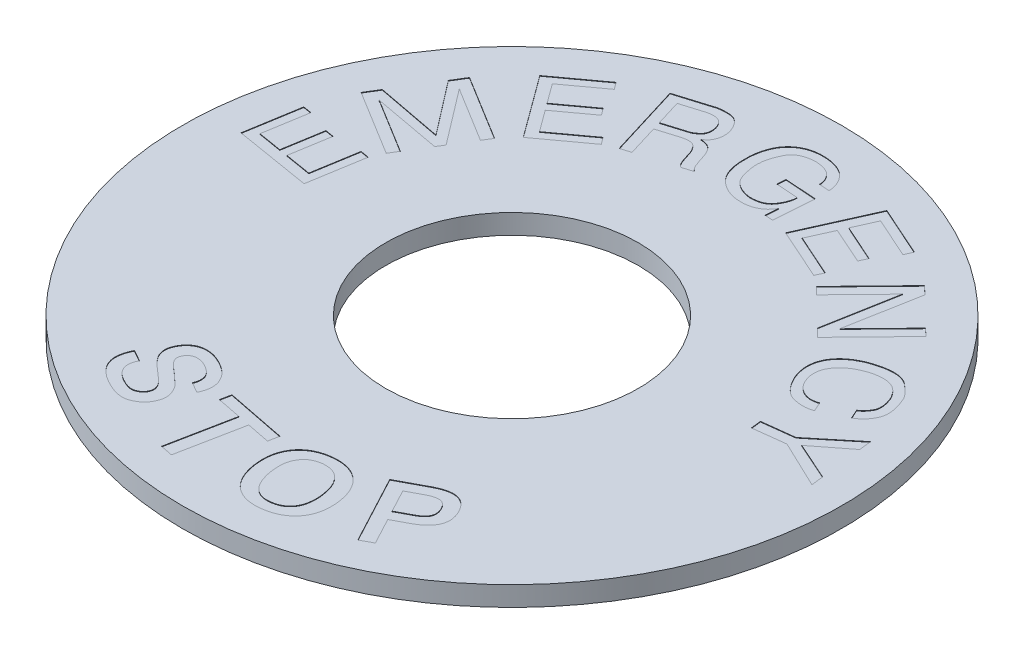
from build123d import *

# Parameters (mm, degrees)
SKETCH_1_W          = 18.5
SKETCH_1_H          = 1.8
CUT_EXTRUDE_1_DEPTH = 0.05
CUT_EXTRUDE_2_DEPTH = 0.05


with BuildPart() as part:
    # Sketch 1 → Revolve 1 (revolve)
    with BuildSketch(Plane.XY, mode=Mode.PRIVATE) as revolve_1_sk:
        with Locations((20.75, 0.9)):
            Rectangle(SKETCH_1_W, SKETCH_1_H)
    revolve(revolve_1_sk.sketch.rotate(Axis((0, 1.8, 0), (0, -1, 0)), 270), axis=Axis((0, 1.8, 0), (0, -1, 0)))

    # Sketch 2 → Cut-Extrude 1 (cut)
    # profile 1 of 9: a face of its own
    with BuildSketch(Plane(origin=(0, 1.8, 0), x_dir=(1, 0, 0), z_dir=(0, 1, 0))):
        Polygon((23.417949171, 2.954229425), (26.388753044, 5.270333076), (26.254737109, 6.377935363), (22.531008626, 3.318514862), (19.643331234, 2.969116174), (19.755808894, 2.039521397), (22.643486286, 2.388920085), (26.988235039, 0.315790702), (26.854219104, 1.423392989), align=None)
    # profile 2 of 9: a face of its own
    with BuildSketch(Plane(origin=(0, 1.8, 0), x_dir=(1, 0, 0), z_dir=(0, 1, 0))):
        with BuildLine():
            add(Edge.make_bspline(
                [(20.889990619, 7.123935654), (20.830537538, 7.103457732), (20.714265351, 7.063409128), (20.536413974, 7.025595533), (20.361522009, 7.000782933), (20.187610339, 6.997781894), (20.015499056, 7.007866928), (19.84587207, 7.039713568), (19.678060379, 7.085226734), (19.514129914, 7.149081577), (19.355311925, 7.227864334), (19.205215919, 7.3238446), (19.063303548, 7.433307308), (18.931381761, 7.559106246), (18.807143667, 7.698033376), (18.694825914, 7.854754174), (18.588726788, 8.023996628), (18.528501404, 8.145884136), (18.497828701, 8.207961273)],
                knots=[0, 0, 0, 0, 1.036290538, 2.026669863, 2.994073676, 3.945500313, 4.89083267, 5.833003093, 6.786770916, 7.755310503, 8.730089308, 9.70638147, 10.689343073, 11.681750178, 12.709240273, 13.758750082, 14.858534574, 16, 16, 16, 16], degree=3))
            add(Edge.make_bspline(
                [(18.497828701, 8.207961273), (18.464433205, 8.291942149), (18.399015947, 8.456449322), (18.33143328, 8.707795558), (18.291910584, 8.954695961), (18.279445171, 9.197010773), (18.297210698, 9.435086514), (18.342255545, 9.668698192), (18.414627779, 9.898304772), (18.516680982, 10.121226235), (18.641384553, 10.3364889), (18.788716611, 10.540719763), (18.954634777, 10.735565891), (19.144624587, 10.915965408), (19.353168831, 11.088050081), (19.58471925, 11.245422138), (19.835789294, 11.393532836), (20.014116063, 11.479551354), (20.105118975, 11.523447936)],
                knots=[0, 0, 0, 0, 1.048224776, 2.053330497, 3.013236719, 3.945598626, 4.862607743, 5.776933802, 6.701104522, 7.649538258, 8.616545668, 9.583762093, 10.568487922, 11.582097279, 12.620305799, 13.703087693, 14.827850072, 16, 16, 16, 16], degree=3))
            add(Edge.make_bspline(
                [(20.105118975, 11.523447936), (20.193548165, 11.563475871), (20.367870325, 11.642383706), (20.63387339, 11.740064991), (20.898069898, 11.819790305), (21.160375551, 11.880933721), (21.420628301, 11.921161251), (21.678801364, 11.943183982), (21.935146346, 11.946125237), (22.188647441, 11.93011049), (22.435348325, 11.888698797), (22.670199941, 11.813240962), (22.890488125, 11.70345095), (23.096686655, 11.560216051), (23.28965604, 11.384733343), (23.465113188, 11.174068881), (23.629756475, 10.933596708), (23.722738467, 10.756185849), (23.770894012, 10.664304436)],
                knots=[0, 0, 0, 0, 1.091572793, 2.151838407, 3.184663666, 4.194230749, 5.178834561, 6.144337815, 7.106491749, 8.059983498, 8.998357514, 9.91282842, 10.824115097, 11.756664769, 12.728516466, 13.748619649, 14.834005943, 16, 16, 16, 16], degree=3))
            add(Edge.make_bspline(
                [(23.770894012, 10.664304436), (23.804341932, 10.577290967), (23.868516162, 10.410344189), (23.941068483, 10.162680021), (23.989673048, 9.930832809), (24.013417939, 9.714029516), (24.014881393, 9.512696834), (23.990588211, 9.325855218), (23.942465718, 9.154238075), (23.867863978, 9.000904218), (23.782407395, 8.862795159), (23.694603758, 8.736258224), (23.606854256, 8.621561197), (23.51703333, 8.519639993), (23.42515305, 8.430839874), (23.332572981, 8.352909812), (23.237330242, 8.28943234), (23.1715287, 8.254991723), (23.13951003, 8.238233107)],
                knots=[0, 0, 0, 0, 1.603592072, 3.076702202, 4.435601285, 5.674685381, 6.824002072, 7.891659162, 8.9070321, 9.876101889, 10.814854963, 11.700198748, 12.525472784, 13.298651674, 14.035427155, 14.722506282, 15.378378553, 16, 16, 16, 16], degree=3))
            Line((23.13951003, 8.238233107), (23.526202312, 7.385293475))
            add(Edge.make_bspline(
                [(23.526202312, 7.385293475), (23.587258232, 7.41868781), (23.709271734, 7.485422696), (23.881267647, 7.604763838), (24.043014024, 7.739178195), (24.194165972, 7.888299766), (24.336897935, 8.049989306), (24.466469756, 8.229047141), (24.586925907, 8.421640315), (24.698515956, 8.62809004), (24.790387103, 8.853217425), (24.845615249, 9.100993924), (24.867459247, 9.367951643), (24.858686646, 9.654840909), (24.812344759, 9.961223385), (24.739330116, 10.288023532), (24.629146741, 10.633694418), (24.536822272, 10.867140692), (24.488768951, 10.988645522)],
                knots=[0, 0, 0, 0, 0.799857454, 1.598426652, 2.402862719, 3.21562535, 4.037986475, 4.880177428, 5.754093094, 6.648948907, 7.576559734, 8.540348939, 9.555428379, 10.650039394, 11.833180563, 13.113414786, 14.497581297, 16, 16, 16, 16], degree=3))
            add(Edge.make_bspline(
                [(24.488768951, 10.988645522), (24.473489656, 11.039703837), (24.441047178, 11.148115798), (24.355681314, 11.30879076), (24.244674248, 11.479871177), (24.102611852, 11.660587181), (23.932556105, 11.851509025), (23.732469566, 12.052260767), (23.502005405, 12.261666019), (23.293471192, 12.443145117), (23.108101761, 12.582903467), (22.953901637, 12.674080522), (22.788728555, 12.750730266), (22.612396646, 12.812468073), (22.425252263, 12.860032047), (22.227609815, 12.893415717), (22.018807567, 12.909361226), (21.799739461, 12.914514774), (21.569635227, 12.901828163), (21.328598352, 12.875683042), (21.076531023, 12.835061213), (20.813538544, 12.779752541), (20.539947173, 12.710385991), (20.255166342, 12.6265898), (19.959993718, 12.526504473), (19.760411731, 12.452292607), (19.658249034, 12.414304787)],
                knots=[0, 0, 0, 0, 0.669854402, 1.422299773, 2.280131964, 3.237717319, 4.313798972, 5.499240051, 6.805685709, 8.23545015, 8.979893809, 9.726180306, 10.487048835, 11.269936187, 12.075809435, 12.916562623, 13.791098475, 14.711210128, 15.674725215, 16.691294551, 17.763898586, 18.88914982, 20.075193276, 21.318074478, 22.627166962, 24, 24, 24, 24], degree=3))
            add(Edge.make_bspline(
                [(19.658249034, 12.414304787), (19.5348442, 12.354489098), (19.294907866, 12.238189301), (18.958728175, 12.04020371), (18.656249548, 11.826207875), (18.384471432, 11.598281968), (18.146260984, 11.353798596), (17.937552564, 11.096439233), (17.76371555, 10.822515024), (17.623681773, 10.534594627), (17.515888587, 10.235684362), (17.445656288, 9.92680012), (17.408657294, 9.610620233), (17.410522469, 9.286374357), (17.442560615, 8.953743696), (17.515719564, 8.614003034), (17.620655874, 8.265994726), (17.7154508, 8.037113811), (17.764097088, 7.919658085)],
                knots=[0, 0, 0, 0, 1.191092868, 2.315844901, 3.384928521, 4.406908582, 5.392897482, 6.346057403, 7.280643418, 8.204813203, 9.122501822, 10.034905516, 10.950921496, 11.881845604, 12.846780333, 13.848897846, 14.896110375, 16, 16, 16, 16], degree=3))
            add(Edge.make_bspline(
                [(17.764097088, 7.919658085), (17.824830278, 7.802882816), (17.941801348, 7.577975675), (18.138920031, 7.268267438), (18.343039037, 6.996226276), (18.555039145, 6.760950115), (18.778300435, 6.566801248), (19.008786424, 6.407957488), (19.249690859, 6.289526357), (19.498348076, 6.213160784), (19.745557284, 6.165661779), (19.985976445, 6.12956331), (20.21965384, 6.112495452), (20.445546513, 6.110617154), (20.664310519, 6.125011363), (20.87514367, 6.154710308), (21.078726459, 6.202276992), (21.209170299, 6.246887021), (21.274188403, 6.269122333)],
                knots=[0, 0, 0, 0, 1.465449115, 2.822429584, 4.083307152, 5.250060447, 6.342550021, 7.371212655, 8.35972147, 9.319415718, 10.258779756, 11.16170277, 12.025723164, 12.865963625, 13.675846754, 14.465242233, 15.235019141, 16, 16, 16, 16], degree=3))
            Line((21.274188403, 6.269122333), (20.889990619, 7.123935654))
        make_face()
    # profile 3 of 9: a face of its own
    with BuildSketch(Plane(origin=(0, 1.8, 0), x_dir=(1, 0, 0), z_dir=(0, 1, 0))):
        Polygon((16.079054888, 19.458764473), (14.88869776, 12.90504176), (15.624263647, 12.189775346), (20.485297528, 17.188766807), (19.814004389, 17.841534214), (15.959898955, 13.878048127), (17.157397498, 20.424826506), (16.414690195, 21.147037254), (11.553656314, 16.148045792), (12.224949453, 15.495278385), align=None)
    # profile 4 of 9: a face of its own
    with BuildSketch(Plane(origin=(0, 1.8, 0), x_dir=(1, 0, 0), z_dir=(0, 1, 0))):
        Polygon((8.416225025, 22.241603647), (9.310950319, 24.241960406), (12.993425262, 22.594852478), (13.314712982, 23.313162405), (8.777540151, 25.34256205), (5.930686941, 18.977790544), (10.56787761, 16.903654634), (10.889165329, 17.621964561), (7.106672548, 19.313808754), (8.094937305, 21.52329372), (11.431896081, 20.030729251), (11.7531838, 20.749039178), align=None)
    # profile 5 of 9: a face of its own
    with BuildSketch(Plane(origin=(0, 1.8, 0), x_dir=(1, 0, 0), z_dir=(0, 1, 0))):
        with BuildLine():
            Line((1.75059009, 23.202484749), (1.695652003, 22.417448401))
            Line((1.695652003, 22.417448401), (3.683085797, 22.278364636))
            add(Edge.make_bspline(
                [(3.683085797, 22.278364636), (3.678770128, 22.219657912), (3.670069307, 22.101299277), (3.64317208, 21.923534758), (3.598375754, 21.745837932), (3.543103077, 21.566476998), (3.470104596, 21.387680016), (3.38322738, 21.208962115), (3.283069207, 21.029171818), (3.170213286, 20.850448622), (3.038810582, 20.67974017), (2.876691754, 20.535085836), (2.693764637, 20.410634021), (2.484251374, 20.312585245), (2.251033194, 20.238513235), (1.994425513, 20.186881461), (1.713795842, 20.160171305), (1.519138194, 20.159590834), (1.417698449, 20.159288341)],
                knots=[0, 0, 0, 0, 0.806980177, 1.626952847, 2.461069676, 3.31747325, 4.19833721, 5.105898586, 6.040811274, 7.018569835, 8.003251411, 8.9826733, 9.984030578, 11.027252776, 12.141923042, 13.331928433, 14.609617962, 16, 16, 16, 16], degree=3))
            add(Edge.make_bspline(
                [(1.417698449, 20.159288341), (1.352714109, 20.170211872), (1.225066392, 20.191668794), (1.039823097, 20.23347065), (0.863904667, 20.282198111), (0.698809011, 20.340317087), (0.542406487, 20.403190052), (0.396473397, 20.473975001), (0.260404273, 20.551693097), (0.134608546, 20.637538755), (0.016891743, 20.728786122), (-0.087778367, 20.831111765), (-0.185245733, 20.93752237), (-0.272301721, 21.051459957), (-0.3471742, 21.174558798), (-0.41516343, 21.302948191), (-0.471705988, 21.439655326), (-0.530334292, 21.627285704), (-0.590504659, 21.857089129), (-0.655404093, 22.119107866), (-0.704076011, 22.361157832), (-0.740933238, 22.582241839), (-0.764462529, 22.782855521), (-0.775454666, 22.962850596), (-0.772761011, 23.122743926), (-0.758469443, 23.221154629), (-0.751783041, 23.267196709)],
                knots=[0, 0, 0, 0, 1.112757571, 2.185772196, 3.205765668, 4.193880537, 5.14029101, 6.051315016, 6.931078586, 7.784161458, 8.621936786, 9.44271661, 10.252835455, 11.057898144, 11.859640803, 12.683623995, 13.509523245, 14.353876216, 16.001622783, 17.521176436, 18.912204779, 20.170327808, 21.305817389, 22.32183212, 23.214858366, 24, 24, 24, 24], degree=3))
            add(Edge.make_bspline(
                [(-0.751783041, 23.267196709), (-0.750905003, 23.324924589), (-0.749084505, 23.44461583), (-0.725370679, 23.62897299), (-0.690137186, 23.824331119), (-0.635251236, 24.029471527), (-0.566130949, 24.245522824), (-0.48033821, 24.472341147), (-0.378938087, 24.70968343), (-0.284949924, 24.913016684), (-0.198804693, 25.07531326), (-0.123998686, 25.191290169), (-0.038469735, 25.297518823), (0.054375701, 25.396529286), (0.15576916, 25.487494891), (0.265333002, 25.571389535), (0.384025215, 25.64659466), (0.511380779, 25.712354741), (0.646440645, 25.772175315), (0.790424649, 25.823853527), (0.943609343, 25.867100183), (1.105104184, 25.901018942), (1.274885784, 25.928627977), (1.452851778, 25.948649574), (1.640008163, 25.960479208), (1.767488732, 25.961081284), (1.83285504, 25.961390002)],
                knots=[0, 0, 0, 0, 0.981801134, 2.035636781, 3.158318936, 4.358242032, 5.646082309, 7.01755135, 8.483175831, 10.037799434, 10.828110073, 11.608330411, 12.382226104, 13.145814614, 13.915899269, 14.6976607, 15.491643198, 16.303612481, 17.134708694, 18.003796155, 18.904618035, 19.841248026, 20.810505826, 21.830912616, 22.88778946, 24, 24, 24, 24], degree=3))
            add(Edge.make_bspline(
                [(1.83285504, 25.961390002), (1.917567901, 25.951352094), (2.081000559, 25.931986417), (2.315276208, 25.887563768), (2.528375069, 25.830503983), (2.720871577, 25.761638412), (2.891747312, 25.679203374), (3.04328721, 25.586015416), (3.17317946, 25.478969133), (3.279532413, 25.358931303), (3.369875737, 25.23466836), (3.447902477, 25.109355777), (3.513309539, 24.983673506), (3.565485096, 24.857183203), (3.60631281, 24.730536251), (3.63370085, 24.603087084), (3.649066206, 24.475091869), (3.648171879, 24.389695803), (3.647723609, 24.346892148)],
                knots=[0, 0, 0, 0, 1.512908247, 2.918784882, 4.22553858, 5.422732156, 6.539713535, 7.585062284, 8.571629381, 9.513091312, 10.421764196, 11.294548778, 12.129426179, 12.93195792, 13.719087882, 14.486448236, 15.241352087, 16, 16, 16, 16], degree=3))
            Line((3.647723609, 24.346892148), (4.582262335, 24.282506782))
            add(Edge.make_bspline(
                [(4.582262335, 24.282506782), (4.578105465, 24.356459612), (4.56985033, 24.503322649), (4.535017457, 24.720546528), (4.479250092, 24.931343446), (4.407747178, 25.137520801), (4.314441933, 25.336797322), (4.20311388, 25.530700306), (4.07242397, 25.718338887), (3.92477996, 25.900694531), (3.75472607, 26.071453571), (3.560716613, 26.225074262), (3.341751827, 26.35809417), (3.099924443, 26.472865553), (2.83543456, 26.571553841), (2.546853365, 26.647692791), (2.235936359, 26.709535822), (2.01953608, 26.733303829), (1.907813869, 26.745574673)],
                knots=[0, 0, 0, 0, 0.884221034, 1.755975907, 2.62174135, 3.485678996, 4.358641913, 5.245546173, 6.152915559, 7.086845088, 8.044504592, 9.025001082, 10.034818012, 11.097471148, 12.217813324, 13.40111485, 14.65825868, 16, 16, 16, 16], degree=3))
            add(Edge.make_bspline(
                [(1.907813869, 26.745574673), (1.780020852, 26.751617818), (1.531054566, 26.763391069), (1.165330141, 26.743921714), (0.818972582, 26.695372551), (0.490038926, 26.618185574), (0.180715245, 26.507789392), (-0.110565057, 26.369422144), (-0.382964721, 26.20048292), (-0.635286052, 26.00166449), (-0.865583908, 25.772508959), (-1.072056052, 25.514640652), (-1.24890541, 25.225581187), (-1.400640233, 24.908937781), (-1.527446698, 24.564350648), (-1.627977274, 24.191006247), (-1.701288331, 23.788722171), (-1.729184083, 23.510105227), (-1.743546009, 23.366661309)],
                knots=[0, 0, 0, 0, 1.086927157, 2.117550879, 3.107581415, 4.056627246, 4.98416045, 5.893943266, 6.792731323, 7.702990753, 8.618513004, 9.548524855, 10.50403478, 11.492319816, 12.52871395, 13.620571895, 14.774968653, 16, 16, 16, 16], degree=3))
            add(Edge.make_bspline(
                [(-1.743546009, 23.366661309), (-1.747077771, 23.281625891), (-1.753999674, 23.114964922), (-1.75318405, 22.869284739), (-1.746822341, 22.632701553), (-1.730689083, 22.405297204), (-1.707557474, 22.186541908), (-1.6779955, 21.976677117), (-1.639206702, 21.775504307), (-1.590854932, 21.584013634), (-1.538396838, 21.400183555), (-1.476644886, 21.225752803), (-1.405498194, 21.060997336), (-1.327637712, 20.90501433), (-1.242790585, 20.757123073), (-1.148551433, 20.618987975), (-1.048286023, 20.488262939), (-0.901744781, 20.330766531), (-0.708928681, 20.150235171), (-0.464191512, 19.957410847), (-0.205644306, 19.79396227), (0.063885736, 19.655965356), (0.346119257, 19.544218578), (0.641268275, 19.461108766), (0.948173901, 19.403399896), (1.157506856, 19.388440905), (1.263456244, 19.380869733)],
                knots=[0, 0, 0, 0, 1.082125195, 2.120857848, 3.123394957, 4.091142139, 5.018946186, 5.920215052, 6.785406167, 7.622703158, 8.430959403, 9.215589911, 9.973770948, 10.711562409, 11.431554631, 12.139941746, 12.836610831, 13.524245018, 14.872951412, 16.191804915, 17.480070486, 18.756223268, 20.037237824, 21.333117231, 22.650214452, 24, 24, 24, 24], degree=3))
            add(Edge.make_bspline(
                [(1.263456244, 19.380869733), (1.331193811, 19.377603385), (1.464241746, 19.371187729), (1.661079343, 19.376480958), (1.85129474, 19.390000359), (2.035248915, 19.416164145), (2.213031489, 19.453478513), (2.384322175, 19.502707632), (2.549396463, 19.561514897), (2.707114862, 19.632226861), (2.856637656, 19.715051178), (2.999364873, 19.805069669), (3.133597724, 19.90556641), (3.257800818, 20.016121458), (3.374985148, 20.135572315), (3.482246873, 20.265253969), (3.582545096, 20.403631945), (3.641236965, 20.501902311), (3.670787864, 20.551380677)],
                knots=[0, 0, 0, 0, 1.148899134, 2.256630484, 3.334600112, 4.379109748, 5.402843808, 6.410649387, 7.397175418, 8.370335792, 9.336074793, 10.291632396, 11.228089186, 12.174162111, 13.107036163, 14.06103112, 15.023744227, 16, 16, 16, 16], degree=3))
            Line((3.670787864, 20.551380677), (3.691961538, 20.55019396))
            Line((3.691961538, 20.55019396), (3.613379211, 19.427293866))
            Line((3.613379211, 19.427293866), (4.338792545, 19.376528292))
            Line((4.338792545, 19.376528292), (4.592620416, 23.003594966))
            Line((4.592620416, 23.003594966), (1.75059009, 23.202484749))
        make_face()
    # profile 6 of 9: a face of its own
    with BuildSketch(Plane(origin=(0, 1.8, 0), x_dir=(1, 0, 0), z_dir=(0, 1, 0))):
        with BuildLine():
            Line((-8.298712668, 18.053027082), (-7.403125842, 18.326810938))
            Line((-7.403125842, 18.326810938), (-8.268166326, 21.156484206))
            Line((-8.268166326, 21.156484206), (-6.362662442, 21.73900305))
            add(Edge.make_bspline(
                [(-6.362662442, 21.73900305), (-6.293140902, 21.756445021), (-6.16031168, 21.789769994), (-5.967040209, 21.821938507), (-5.789434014, 21.836030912), (-5.628283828, 21.831105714), (-5.482532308, 21.807726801), (-5.354679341, 21.762492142), (-5.241191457, 21.700466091), (-5.117615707, 21.586964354), (-4.986622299, 21.422658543), (-4.85277735, 21.204769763), (-4.744576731, 20.963480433), (-4.696277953, 20.791101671), (-4.671565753, 20.702903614)],
                knots=[0, 0, 0, 0, 1.112617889, 2.125789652, 3.038516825, 3.874692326, 4.624151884, 5.320276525, 5.971788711, 6.616817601, 7.910322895, 9.223221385, 10.579253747, 12, 12, 12, 12], degree=3))
            add(Edge.make_bspline(
                [(-4.671565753, 20.702903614), (-4.655738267, 20.652440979), (-4.625129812, 20.554852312), (-4.580450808, 20.414065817), (-4.539277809, 20.283308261), (-4.497073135, 20.164589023), (-4.458313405, 20.056415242), (-4.422279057, 19.959158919), (-4.388072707, 19.872939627), (-4.34461708, 19.774036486), (-4.286869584, 19.663770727), (-4.201930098, 19.548680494), (-4.105123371, 19.448429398), (-4.030054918, 19.395768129), (-3.992611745, 19.369501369)],
                knots=[0, 0, 0, 0, 1.246175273, 2.409953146, 3.480555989, 4.476018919, 5.378543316, 6.188227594, 6.91989817, 7.563679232, 8.733883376, 9.843528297, 10.924379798, 12, 12, 12, 12], degree=3))
            Line((-3.992611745, 19.369501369), (-3.049049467, 19.657866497))
            add(Edge.make_bspline(
                [(-3.049049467, 19.657866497), (-3.093103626, 19.693233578), (-3.180182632, 19.7631414), (-3.292665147, 19.887637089), (-3.38507553, 20.02720684), (-3.447409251, 20.155532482), (-3.492887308, 20.267969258), (-3.527834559, 20.364856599), (-3.569434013, 20.471197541), (-3.610367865, 20.589904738), (-3.655505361, 20.718845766), (-3.70060403, 20.859341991), (-3.752310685, 21.009006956), (-3.785275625, 21.113175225), (-3.802331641, 21.167071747)],
                knots=[0, 0, 0, 0, 1.183534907, 2.339416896, 3.502220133, 4.683095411, 5.325024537, 6.045741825, 6.843133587, 7.719708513, 8.679048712, 9.708460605, 10.8143606, 12, 12, 12, 12], degree=3))
            add(Edge.make_bspline(
                [(-3.802331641, 21.167071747), (-3.828711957, 21.251680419), (-3.880344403, 21.417279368), (-3.981416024, 21.651961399), (-4.102314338, 21.866161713), (-4.215865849, 22.031692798), (-4.321197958, 22.151925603), (-4.416231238, 22.229511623), (-4.523713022, 22.297648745), (-4.644336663, 22.355180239), (-4.778115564, 22.403019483), (-4.925610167, 22.439226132), (-5.086214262, 22.469371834), (-5.1985454, 22.47846065), (-5.256821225, 22.4831758)],
                knots=[0, 0, 0, 0, 1.495406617, 2.926860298, 4.303225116, 5.642202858, 6.308416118, 6.993856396, 7.704925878, 8.452266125, 9.245059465, 10.098867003, 11.013718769, 12, 12, 12, 12], degree=3))
            Line((-5.256821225, 22.4831758), (-5.265468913, 22.511970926))
            add(Edge.make_bspline(
                [(-5.265468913, 22.511970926), (-5.224562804, 22.536630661), (-5.143458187, 22.585523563), (-5.033098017, 22.672037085), (-4.934058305, 22.767428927), (-4.843881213, 22.868821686), (-4.767524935, 22.981500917), (-4.701037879, 23.100970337), (-4.645700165, 23.228870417), (-4.589188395, 23.409945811), (-4.542012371, 23.644410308), (-4.528342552, 23.932199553), (-4.552842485, 24.222857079), (-4.601983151, 24.412452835), (-4.626878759, 24.508505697)],
                knots=[0, 0, 0, 0, 0.758147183, 1.503179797, 2.221137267, 2.940553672, 3.653993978, 4.378252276, 5.109832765, 5.862914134, 7.388158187, 8.893643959, 10.426260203, 12, 12, 12, 12], degree=3))
            add(Edge.make_bspline(
                [(-4.626878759, 24.508505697), (-4.664013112, 24.603460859), (-4.734983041, 24.784935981), (-4.865247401, 25.033779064), (-5.009562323, 25.246934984), (-5.165124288, 25.427286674), (-5.335857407, 25.571107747), (-5.520220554, 25.680018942), (-5.7184184, 25.753812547), (-5.927010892, 25.786212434), (-6.134495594, 25.798158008), (-6.337024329, 25.803534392), (-6.5313229, 25.797048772), (-6.718299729, 25.784141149), (-6.896442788, 25.756658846), (-7.067486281, 25.725223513), (-7.229524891, 25.679892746), (-7.333292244, 25.642628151), (-7.384498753, 25.624239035)],
                knots=[0, 0, 0, 0, 1.436381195, 2.745163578, 3.949311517, 5.057937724, 6.091620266, 7.081297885, 8.062690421, 9.052576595, 10.043736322, 10.992159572, 11.90690193, 12.78322686, 13.631868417, 14.44611036, 15.23319559, 16, 16, 16, 16], degree=3))
            Line((-7.384498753, 25.624239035), (-10.337528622, 24.722290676))
            Line((-10.337528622, 24.722290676), (-8.298712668, 18.053027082))
        make_face()
        with BuildLine():
            Line((-9.211846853, 24.243400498), (-7.344453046, 24.814268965))
            add(Edge.make_bspline(
                [(-7.344453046, 24.814268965), (-7.292615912, 24.830181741), (-7.191186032, 24.861318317), (-7.039415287, 24.897097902), (-6.89275396, 24.923951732), (-6.750981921, 24.937500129), (-6.614770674, 24.944472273), (-6.48296307, 24.938918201), (-6.356475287, 24.920641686), (-6.23439107, 24.896542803), (-6.119207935, 24.855693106), (-6.011656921, 24.79924619), (-5.91278564, 24.726124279), (-5.822147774, 24.637116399), (-5.742346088, 24.530533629), (-5.667764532, 24.410032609), (-5.603116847, 24.272483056), (-5.568710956, 24.173465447), (-5.550890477, 24.122179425)],
                knots=[0, 0, 0, 0, 1.180536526, 2.309959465, 3.393769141, 4.424556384, 5.409053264, 6.362187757, 7.291533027, 8.19045464, 9.067489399, 9.942774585, 10.825967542, 11.736086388, 12.69882219, 13.718180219, 14.81813487, 16, 16, 16, 16], degree=3))
            add(Edge.make_bspline(
                [(-5.550890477, 24.122179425), (-5.536691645, 24.060418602), (-5.509370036, 23.941577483), (-5.489600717, 23.766650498), (-5.485804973, 23.604383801), (-5.499475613, 23.4540802), (-5.532214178, 23.315825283), (-5.584704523, 23.190451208), (-5.65467539, 23.077322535), (-5.770097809, 22.948697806), (-5.925979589, 22.81313421), (-6.116056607, 22.679139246), (-6.304965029, 22.578118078), (-6.435212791, 22.53933904), (-6.49796645, 22.520655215)],
                knots=[0, 0, 0, 0, 1.08193845, 2.081882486, 3.001463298, 3.85099014, 4.653398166, 5.418752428, 6.163624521, 6.914264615, 8.362281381, 9.683126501, 10.883725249, 12, 12, 12, 12], degree=3))
            Line((-6.49796645, 22.520655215), (-8.498261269, 21.90915824))
            Line((-8.498261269, 21.90915824), (-9.211846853, 24.243400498))
        make_face(mode=Mode.SUBTRACT)
    # profile 7 of 9: a face of its own
    with BuildSketch(Plane(origin=(0, 1.8, 0), x_dir=(1, 0, 0), z_dir=(0, 1, 0))):
        Polygon((-15.143063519, 18.338429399), (-16.437612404, 20.107130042), (-13.181595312, 22.490276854), (-13.646456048, 23.125401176), (-17.658190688, 20.18912893), (-13.539171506, 14.561445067), (-9.439001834, 17.562444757), (-9.90386257, 18.197569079), (-13.248314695, 15.749694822), (-14.678202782, 17.703305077), (-11.727688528, 19.862847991), (-12.192549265, 20.497972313), align=None)
    # profile 8 of 9: a face of its own
    with BuildSketch(Plane(origin=(0, 1.8, 0), x_dir=(1, 0, 0), z_dir=(0, 1, 0))):
        Polygon((-16.840825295, 9.802715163), (-16.444115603, 10.447528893), (-20.24802841, 15.442765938), (-20.232368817, 15.468219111), (-20.013729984, 15.310313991), (-15.253986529, 12.381970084), (-14.763319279, 13.179502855), (-20.702393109, 16.833407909), (-21.438393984, 15.637108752), (-17.694534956, 10.772385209), (-23.724694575, 11.920945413), (-24.46069545, 10.724646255), (-18.52162162, 7.070741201), (-18.03095437, 7.868273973), (-22.790697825, 10.79661788), (-23.030216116, 10.920585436), (-23.019776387, 10.937554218), align=None)
    # profile 9 of 9: a face of its own
    with BuildSketch(Plane(origin=(0, 1.8, 0), x_dir=(1, 0, 0), z_dir=(0, 1, 0))):
        Polygon((-23.649245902, 2.508542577), (-25.811266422, 2.866556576), (-25.152195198, 6.846639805), (-25.928557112, 6.975199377), (-26.740597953, 2.071343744), (-19.861441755, 0.932208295), (-19.031500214, 5.944164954), (-19.807862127, 6.072724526), (-20.484834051, 1.984540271), (-22.872883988, 2.379983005), (-22.275651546, 5.986626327), (-23.05201346, 6.115185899), align=None)
    extrude(amount=-CUT_EXTRUDE_1_DEPTH, mode=Mode.SUBTRACT)

    # Sketch 4 → Cut-Extrude 2 (cut)
    # profile 1 of 4: a face of its own
    with BuildSketch(Plane(origin=(0, 1.8, 0), x_dir=(1, 0, 0), z_dir=(0, 1, 0))):
        with BuildLine():
            Line((-14.429915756, -19.940120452), (-13.383426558, -20.522103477))
            add(Edge.make_bspline(
                [(-13.383426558, -20.522103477), (-13.421799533, -20.594597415), (-13.49531398, -20.733480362), (-13.571134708, -20.948209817), (-13.61771792, -21.154486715), (-13.630499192, -21.35464813), (-13.611038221, -21.548266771), (-13.56176406, -21.737484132), (-13.480559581, -21.921466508), (-13.371309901, -22.10197357), (-13.228918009, -22.276715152), (-13.050028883, -22.441831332), (-12.838075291, -22.601196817), (-12.679181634, -22.693699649), (-12.59619662, -22.742010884)],
                knots=[0, 0, 0, 0, 1.097461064, 2.102501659, 3.040329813, 3.922301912, 4.776636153, 5.636547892, 6.5303937, 7.461042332, 8.455446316, 9.538905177, 10.714649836, 12, 12, 12, 12], degree=3))
            add(Edge.make_bspline(
                [(-12.59619662, -22.742010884), (-12.529076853, -22.778344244), (-12.400127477, -22.848147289), (-12.208631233, -22.936073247), (-12.028255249, -23.004720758), (-11.859618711, -23.053094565), (-11.702766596, -23.086337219), (-11.556507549, -23.097851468), (-11.421409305, -23.088687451), (-11.298042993, -23.061204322), (-11.186178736, -23.019216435), (-11.081631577, -22.972374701), (-10.985352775, -22.918163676), (-10.896992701, -22.857363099), (-10.817501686, -22.789419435), (-10.744524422, -22.71659096), (-10.682361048, -22.634470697), (-10.646748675, -22.575794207), (-10.628796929, -22.546216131)],
                knots=[0, 0, 0, 0, 1.640238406, 3.151198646, 4.52591609, 5.784461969, 6.919134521, 7.966909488, 8.927137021, 9.819138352, 10.67301845, 11.491352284, 12.279799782, 13.044684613, 13.792928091, 14.524983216, 15.256462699, 16, 16, 16, 16], degree=3))
            add(Edge.make_bspline(
                [(-10.628796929, -22.546216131), (-10.602511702, -22.495267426), (-10.551784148, -22.396942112), (-10.51018253, -22.240745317), (-10.49641982, -22.087755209), (-10.51549026, -21.939230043), (-10.557423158, -21.798252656), (-10.61202903, -21.663380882), (-10.684751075, -21.538239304), (-10.773364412, -21.420547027), (-10.877015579, -21.305637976), (-10.992265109, -21.18447028), (-11.122561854, -21.058454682), (-11.216336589, -20.974584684), (-11.264792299, -20.931246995)],
                knots=[0, 0, 0, 0, 1.079737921, 2.083773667, 3.030226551, 3.963151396, 4.891224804, 5.801896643, 6.70424221, 7.615310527, 8.578706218, 9.624634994, 10.772590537, 12, 12, 12, 12], degree=3))
            add(Edge.make_bspline(
                [(-11.264792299, -20.931246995), (-11.40031295, -20.813816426), (-11.679001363, -20.572328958), (-12.028544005, -20.268159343), (-12.303889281, -20.015706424), (-12.491450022, -19.824208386), (-12.658395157, -19.634912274), (-12.80531158, -19.446635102), (-12.928721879, -19.252788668), (-13.01952237, -19.045798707), (-13.083458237, -18.828516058), (-13.112866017, -18.639386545), (-13.120706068, -18.483599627), (-13.115002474, -18.363387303), (-13.098808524, -18.241393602), (-13.070948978, -18.117990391), (-13.034671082, -17.991921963), (-12.987141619, -17.863843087), (-12.929183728, -17.733790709), (-12.883047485, -17.648801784), (-12.859506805, -17.60543681)],
                knots=[0, 0, 0, 0, 2.364140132, 4.861683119, 6.108761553, 7.28791608, 8.393777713, 9.434700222, 10.434203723, 11.414497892, 12.404069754, 13.412866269, 13.929678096, 14.458345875, 14.997140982, 15.550031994, 16.124690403, 16.725471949, 17.34968143, 18, 18, 18, 18], degree=3))
            add(Edge.make_bspline(
                [(-12.859506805, -17.60543681), (-12.81250529, -17.527047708), (-12.719594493, -17.372091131), (-12.545709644, -17.166659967), (-12.350806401, -16.985875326), (-12.169499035, -16.858337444), (-12.013189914, -16.771671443), (-11.888718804, -16.715879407), (-11.757301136, -16.672013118), (-11.620319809, -16.636147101), (-11.47653586, -16.612472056), (-11.326339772, -16.597736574), (-11.169813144, -16.592125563), (-11.007020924, -16.598115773), (-10.838552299, -16.613499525), (-10.665101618, -16.644325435), (-10.486394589, -16.686021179), (-10.302863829, -16.741574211), (-10.115264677, -16.811049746), (-9.922742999, -16.892326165), (-9.725677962, -16.98709046), (-9.594196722, -17.05760314), (-9.526945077, -17.093669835)],
                knots=[0, 0, 0, 0, 1.437710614, 2.842011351, 4.221757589, 5.616306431, 6.32077064, 7.034872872, 7.761292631, 8.500708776, 9.262986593, 10.053809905, 10.876716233, 11.7279655, 12.61826564, 13.539067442, 14.500383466, 15.50746043, 16.557182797, 17.6501173, 18.798053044, 20, 20, 20, 20], degree=3))
            add(Edge.make_bspline(
                [(-9.526945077, -17.093669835), (-9.462715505, -17.130949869), (-9.337153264, -17.203828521), (-9.157878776, -17.319872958), (-8.993181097, -17.442112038), (-8.840150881, -17.566632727), (-8.702119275, -17.697462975), (-8.575858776, -17.830257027), (-8.464832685, -17.969132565), (-8.366499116, -18.110631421), (-8.280102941, -18.253718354), (-8.205299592, -18.397000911), (-8.143597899, -18.540411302), (-8.091480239, -18.68211779), (-8.052375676, -18.823572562), (-8.023605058, -18.963793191), (-8.00702446, -19.10384861), (-8.002657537, -19.290390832), (-8.018393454, -19.526070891), (-8.074359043, -19.811171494), (-8.162916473, -20.100764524), (-8.247041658, -20.289304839), (-8.290062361, -20.385722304)],
                knots=[0, 0, 0, 0, 1.128099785, 2.205319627, 3.241931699, 4.242606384, 5.200358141, 6.12911416, 7.023977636, 7.898388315, 8.745036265, 9.56157811, 10.351668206, 11.115186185, 11.853424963, 12.578887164, 13.287923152, 13.992494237, 15.411110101, 16.866104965, 18.397360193, 20, 20, 20, 20], degree=3))
            Line((-8.290062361, -20.385722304), (-9.258233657, -19.846949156))
            add(Edge.make_bspline(
                [(-9.258233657, -19.846949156), (-9.239555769, -19.80355732), (-9.20308896, -19.718838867), (-9.160636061, -19.589266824), (-9.131512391, -19.460799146), (-9.111176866, -19.334044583), (-9.107337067, -19.20828148), (-9.109611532, -19.083853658), (-9.128618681, -18.960641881), (-9.156133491, -18.838035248), (-9.199225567, -18.716537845), (-9.26249155, -18.59823865), (-9.344483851, -18.483289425), (-9.444401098, -18.370608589), (-9.56181752, -18.259643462), (-9.699832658, -18.153900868), (-9.853666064, -18.047515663), (-9.965730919, -17.983151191), (-10.023858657, -17.949765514)],
                knots=[0, 0, 0, 0, 0.982764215, 1.918754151, 2.832115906, 3.722274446, 4.584802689, 5.446974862, 6.307976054, 7.173600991, 8.059461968, 8.981237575, 9.955754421, 10.991076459, 12.110867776, 13.311894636, 14.605687, 16, 16, 16, 16], degree=3))
            add(Edge.make_bspline(
                [(-10.023858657, -17.949765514), (-10.090445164, -17.914614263), (-10.218767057, -17.846872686), (-10.411719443, -17.764252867), (-10.598225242, -17.709118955), (-10.77546305, -17.673482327), (-10.94374532, -17.663681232), (-11.102557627, -17.66942162), (-11.250866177, -17.702130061), (-11.389616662, -17.750824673), (-11.515845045, -17.822591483), (-11.628564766, -17.913641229), (-11.72762141, -18.024595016), (-11.779654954, -18.109989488), (-11.806266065, -18.153662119)],
                knots=[0, 0, 0, 0, 1.3442113, 2.590490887, 3.739738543, 4.811519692, 5.810117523, 6.74359778, 7.638865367, 8.510853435, 9.36014082, 10.2173759, 11.088326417, 12, 12, 12, 12], degree=3))
            add(Edge.make_bspline(
                [(-11.806266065, -18.153662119), (-11.832944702, -18.206871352), (-11.883252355, -18.307207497), (-11.925982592, -18.463393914), (-11.932881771, -18.612927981), (-11.902084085, -18.752988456), (-11.848210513, -18.882827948), (-11.777636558, -19.004414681), (-11.697559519, -19.122297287), (-11.614570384, -19.212309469), (-11.539058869, -19.284921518), (-11.474733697, -19.347120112), (-11.401104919, -19.414816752), (-11.319245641, -19.489226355), (-11.227021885, -19.56786511), (-11.128407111, -19.65526549), (-11.020638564, -19.748304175), (-10.944865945, -19.811505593), (-10.9056102, -19.844248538)],
                knots=[0, 0, 0, 0, 1.347048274, 2.540116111, 3.642970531, 4.705672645, 5.763070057, 6.81869331, 7.888768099, 8.987080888, 9.586032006, 10.264466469, 11.015459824, 11.853606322, 12.772305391, 13.76299463, 14.841068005, 16, 16, 16, 16], degree=3))
            add(Edge.make_bspline(
                [(-10.9056102, -19.844248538), (-10.851919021, -19.889556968), (-10.747034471, -19.978065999), (-10.595603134, -20.110226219), (-10.454711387, -20.23910179), (-10.319542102, -20.360370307), (-10.194965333, -20.478930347), (-10.078162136, -20.592602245), (-9.970710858, -20.701693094), (-9.837979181, -20.839723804), (-9.689074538, -21.021422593), (-9.544746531, -21.266111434), (-9.427734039, -21.534200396), (-9.35710228, -21.774542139), (-9.320502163, -21.976289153), (-9.30773838, -22.132378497), (-9.313830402, -22.291255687), (-9.335821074, -22.452588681), (-9.373256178, -22.616577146), (-9.430733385, -22.781800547), (-9.499409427, -22.951340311), (-9.55871995, -23.061199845), (-9.589059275, -23.117396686)],
                knots=[0, 0, 0, 0, 1.076498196, 2.102915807, 3.079509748, 4.002284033, 4.885335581, 5.714462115, 6.499654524, 7.23144619, 8.648949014, 10.087255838, 11.569778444, 13.121591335, 13.913059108, 14.708633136, 15.516047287, 16.344169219, 17.200752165, 18.088424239, 19.022164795, 20, 20, 20, 20], degree=3))
            add(Edge.make_bspline(
                [(-9.589059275, -23.117396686), (-9.621748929, -23.172116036), (-9.687058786, -23.281438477), (-9.804242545, -23.432767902), (-9.935729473, -23.572610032), (-10.082922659, -23.700398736), (-10.24509093, -23.815967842), (-10.421792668, -23.921151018), (-10.614657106, -24.011604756), (-10.784315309, -24.080434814), (-10.928799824, -24.123741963), (-11.043041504, -24.147802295), (-11.162096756, -24.164985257), (-11.286363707, -24.168587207), (-11.414899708, -24.168457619), (-11.548280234, -24.156398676), (-11.686419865, -24.138396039), (-11.829010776, -24.108854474), (-11.976573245, -24.072814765), (-12.128574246, -24.026339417), (-12.28604264, -23.972546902), (-12.4473786, -23.907951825), (-12.615610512, -23.839047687), (-12.786340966, -23.75695878), (-12.962413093, -23.667884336), (-13.080218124, -23.603815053), (-13.140371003, -23.57110039)],
                knots=[0, 0, 0, 0, 1.132736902, 2.263067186, 3.395606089, 4.541698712, 5.723463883, 6.932909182, 8.193178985, 9.508697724, 10.18493738, 10.872592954, 11.583521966, 12.32064624, 13.081130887, 13.868196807, 14.700257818, 15.557391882, 16.45626901, 17.400852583, 18.383047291, 19.414654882, 20.490976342, 21.615310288, 22.782344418, 24, 24, 24, 24], degree=3))
            add(Edge.make_bspline(
                [(-13.140371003, -23.57110039), (-13.238491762, -23.514937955), (-13.428754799, -23.406035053), (-13.691278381, -23.223466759), (-13.927218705, -23.035890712), (-14.136911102, -22.842128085), (-14.31581619, -22.638130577), (-14.468587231, -22.428634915), (-14.592469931, -22.211337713), (-14.688431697, -21.986765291), (-14.754228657, -21.754339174), (-14.794669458, -21.515234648), (-14.802681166, -21.268578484), (-14.785366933, -21.015050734), (-14.737952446, -20.754796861), (-14.664883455, -20.48741229), (-14.561047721, -20.213771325), (-14.474486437, -20.033132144), (-14.429915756, -19.940120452)],
                knots=[0, 0, 0, 0, 1.238458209, 2.401457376, 3.499959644, 4.539925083, 5.525501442, 6.46875792, 7.376685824, 8.260772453, 9.138187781, 10.018026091, 10.911488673, 11.836105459, 12.797893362, 13.805454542, 14.870021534, 16, 16, 16, 16], degree=3))
        make_face()
    # profile 2 of 4: a face of its own
    with BuildSketch(Plane(origin=(0, 1.8, 0), x_dir=(1, 0, 0), z_dir=(0, 1, 0))):
        Polygon((-4.480832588, -20.38056277), (-6.689937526, -19.941712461), (-6.500894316, -18.991095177), (-1.04834802, -20.072692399), (-1.23739123, -21.023309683), (-3.357375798, -20.603363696), (-4.522692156, -26.479906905), (-5.646148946, -26.25710598), align=None)
    # profile 3 of 4: a face of its own
    with BuildSketch(Plane(origin=(0, 1.8, 0), x_dir=(1, 0, 0), z_dir=(0, 1, 0))):
        with BuildLine():
            add(Edge.make_bspline(
                [(3.895362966, -26.614936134), (3.809036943, -26.62615109), (3.639028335, -26.648237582), (3.386157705, -26.666046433), (3.140734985, -26.667981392), (2.902738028, -26.652107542), (2.671923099, -26.625144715), (2.448263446, -26.57980406), (2.231976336, -26.520746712), (2.023419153, -26.446275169), (1.823836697, -26.35743505), (1.633916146, -26.254247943), (1.453739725, -26.137851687), (1.283202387, -26.00772631), (1.121528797, -25.864217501), (0.971007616, -25.705633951), (0.828224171, -25.535500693), (0.697804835, -25.350894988), (0.575755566, -25.155146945), (0.46578142, -24.947162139), (0.365396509, -24.729094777), (0.276092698, -24.500059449), (0.198216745, -24.260056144), (0.130965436, -24.008879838), (0.071971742, -23.747851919), (0.04373049, -23.568826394), (0.029429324, -23.478169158)],
                knots=[0, 0, 0, 0, 1.10924282, 2.184518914, 3.228540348, 4.234373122, 5.222648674, 6.187881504, 7.139760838, 8.077798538, 9.007361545, 9.921144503, 10.829672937, 11.738328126, 12.652489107, 13.581574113, 14.522413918, 15.480649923, 16.459608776, 17.460423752, 18.476849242, 19.517587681, 20.591485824, 21.690776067, 22.830625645, 24, 24, 24, 24], degree=3))
            add(Edge.make_bspline(
                [(0.029429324, -23.478169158), (0.01196326, -23.344690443), (-0.022283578, -23.082970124), (-0.035972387, -22.694491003), (-0.02184086, -22.320212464), (0.021732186, -21.960716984), (0.097454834, -21.618004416), (0.202522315, -21.293838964), (0.338012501, -20.989475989), (0.503452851, -20.706146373), (0.696941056, -20.444209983), (0.919086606, -20.206771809), (1.170382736, -19.996102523), (1.448100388, -19.810367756), (1.753777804, -19.652692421), (2.084331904, -19.520864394), (2.44185013, -19.4210111), (2.69043729, -19.377812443), (2.817816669, -19.355676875)],
                knots=[0, 0, 0, 0, 1.146475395, 2.247968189, 3.307306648, 4.335273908, 5.329048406, 6.293225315, 7.234015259, 8.162126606, 9.083342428, 10.003144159, 10.925819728, 11.87142823, 12.844027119, 13.851033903, 14.898841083, 16, 16, 16, 16], degree=3))
            add(Edge.make_bspline(
                [(2.817816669, -19.355676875), (2.88527313, -19.346652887), (3.018568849, -19.328821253), (3.217172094, -19.310586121), (3.411913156, -19.304501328), (3.602435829, -19.3058576), (3.788727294, -19.31415536), (3.970600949, -19.335655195), (4.148409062, -19.363002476), (4.377333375, -19.413651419), (4.651824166, -19.496091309), (4.963246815, -19.626830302), (5.251482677, -19.791750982), (5.516993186, -19.987037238), (5.759334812, -20.210686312), (5.978019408, -20.461264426), (6.173661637, -20.737605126), (6.34143936, -21.042132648), (6.487509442, -21.368542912), (6.607148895, -21.718679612), (6.705682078, -22.089381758), (6.748414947, -22.346627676), (6.770170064, -22.477590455)],
                knots=[0, 0, 0, 0, 0.715950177, 1.414736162, 2.09701095, 2.764686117, 3.418979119, 4.057454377, 4.690356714, 5.310789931, 6.522668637, 7.700288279, 8.856144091, 10.007792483, 11.160550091, 12.318266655, 13.500655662, 14.715306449, 15.970152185, 17.257995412, 18.604057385, 20, 20, 20, 20], degree=3))
            add(Edge.make_bspline(
                [(6.770170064, -22.477590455), (6.787675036, -22.610169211), (6.821933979, -22.869638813), (6.835124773, -23.254930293), (6.823089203, -23.625634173), (6.779931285, -23.981732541), (6.707959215, -24.321694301), (6.603510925, -24.643998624), (6.467874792, -24.947545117), (6.303153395, -25.232832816), (6.106094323, -25.496197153), (5.877895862, -25.737158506), (5.61670139, -25.951973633), (5.326137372, -26.142944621), (5.007556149, -26.308046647), (4.660160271, -26.440848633), (4.288001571, -26.547777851), (4.028231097, -26.592209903), (3.895362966, -26.614936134)],
                knots=[0, 0, 0, 0, 1.123081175, 2.197979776, 3.234942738, 4.23694924, 5.207956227, 6.150415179, 7.078174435, 7.996698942, 8.912705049, 9.83564928, 10.778464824, 11.747702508, 12.75246743, 13.787013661, 14.868095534, 16, 16, 16, 16], degree=3))
        make_face()
        with BuildLine():
            add(Edge.make_bspline(
                [(3.756281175, -25.66431885), (3.813109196, -25.654578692), (3.924712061, -25.635450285), (4.08752675, -25.596748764), (4.241035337, -25.546376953), (4.386607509, -25.488413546), (4.523230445, -25.421098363), (4.65087611, -25.343549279), (4.770246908, -25.256968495), (4.880858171, -25.160684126), (4.98391296, -25.05689568), (5.076949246, -24.944493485), (5.161321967, -24.824811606), (5.236570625, -24.697668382), (5.304806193, -24.563667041), (5.362550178, -24.421698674), (5.411145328, -24.272194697), (5.465602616, -24.061147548), (5.511187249, -23.780730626), (5.533594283, -23.427630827), (5.522644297, -23.053790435), (5.490463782, -22.800112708), (5.473873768, -22.669334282)],
                knots=[0, 0, 0, 0, 0.884065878, 1.736190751, 2.563464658, 3.359421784, 4.137306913, 4.896093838, 5.647149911, 6.395823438, 7.142585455, 7.887590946, 8.630611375, 9.385842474, 10.151380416, 10.934545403, 11.733430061, 12.560444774, 14.275034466, 16.080363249, 17.979310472, 20, 20, 20, 20], degree=3))
            add(Edge.make_bspline(
                [(5.473873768, -22.669334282), (5.463405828, -22.604014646), (5.442922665, -22.47620032), (5.407190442, -22.289376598), (5.363445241, -22.112652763), (5.315895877, -21.944776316), (5.266105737, -21.785303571), (5.206614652, -21.636528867), (5.145531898, -21.495678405), (5.056608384, -21.324662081), (4.938439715, -21.130995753), (4.785211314, -20.924707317), (4.619560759, -20.753229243), (4.445263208, -20.613450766), (4.263593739, -20.50499785), (4.081076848, -20.414916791), (3.893647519, -20.352069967), (3.705219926, -20.309900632), (3.516894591, -20.288275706), (3.330164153, -20.27818077), (3.144418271, -20.28292335), (3.022070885, -20.298508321), (2.960949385, -20.306294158)],
                knots=[0, 0, 0, 0, 1.015203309, 1.986501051, 2.917979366, 3.80796546, 4.664263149, 5.480070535, 6.265575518, 7.019371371, 8.436218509, 9.743109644, 10.954570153, 12.085110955, 13.160763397, 14.195725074, 15.202717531, 16.186437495, 17.153723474, 18.108173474, 19.054893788, 20, 20, 20, 20], degree=3))
            add(Edge.make_bspline(
                [(2.960949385, -20.306294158), (2.894059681, -20.318572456), (2.757802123, -20.343583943), (2.554071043, -20.405326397), (2.349463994, -20.490505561), (2.177836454, -20.574526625), (2.042616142, -20.657878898), (1.944461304, -20.734925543), (1.850580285, -20.825470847), (1.759999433, -20.928235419), (1.673619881, -21.044961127), (1.59163588, -21.17479819), (1.513302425, -21.317319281), (1.438186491, -21.472261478), (1.373198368, -21.642614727), (1.321606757, -21.829197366), (1.285912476, -22.032209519), (1.264624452, -22.251601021), (1.258802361, -22.487056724), (1.26570933, -22.739011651), (1.287195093, -23.007231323), (1.312632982, -23.190663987), (1.32572562, -23.285075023)],
                knots=[0, 0, 0, 0, 1.058579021, 2.156376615, 3.307126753, 4.507822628, 5.128276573, 5.777524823, 6.446860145, 7.157087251, 7.908564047, 8.705887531, 9.546765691, 10.440368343, 11.385548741, 12.382176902, 13.450574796, 14.59171946, 15.811962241, 17.116292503, 18.515783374, 20, 20, 20, 20], degree=3))
            add(Edge.make_bspline(
                [(1.32572562, -23.285075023), (1.344825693, -23.402083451), (1.382388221, -23.632194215), (1.473349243, -23.965651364), (1.579348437, -24.285019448), (1.689636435, -24.537942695), (1.791127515, -24.727880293), (1.871410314, -24.862532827), (1.961344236, -24.986849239), (2.056943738, -25.102778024), (2.158482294, -25.210683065), (2.268172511, -25.307835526), (2.385022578, -25.395763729), (2.50761597, -25.475739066), (2.637508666, -25.545662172), (2.776040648, -25.600330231), (2.921281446, -25.6444093), (3.074343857, -25.67333092), (3.234612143, -25.690913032), (3.402088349, -25.696204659), (3.577302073, -25.688254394), (3.695609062, -25.672432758), (3.756281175, -25.66431885)],
                knots=[0, 0, 0, 0, 1.842817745, 3.624116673, 5.368648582, 7.073926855, 7.907020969, 8.717451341, 9.51011896, 10.290856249, 11.053460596, 11.812166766, 12.566857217, 13.326112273, 14.087140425, 14.856749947, 15.638616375, 16.444559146, 17.275650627, 18.144200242, 19.048278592, 20, 20, 20, 20], degree=3))
        make_face(mode=Mode.SUBTRACT)
    # profile 4 of 4: a face of its own
    with BuildSketch(Plane(origin=(0, 1.8, 0), x_dir=(1, 0, 0), z_dir=(0, 1, 0))):
        with BuildLine():
            Line((7.355691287, -18.483408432), (9.844310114, -17.154704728))
            add(Edge.make_bspline(
                [(9.844310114, -17.154704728), (9.932913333, -17.109077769), (10.104711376, -17.020608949), (10.36296295, -16.909479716), (10.612454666, -16.822171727), (10.852624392, -16.758284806), (11.083389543, -16.716962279), (11.304581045, -16.698223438), (11.517009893, -16.705128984), (11.720185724, -16.734253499), (11.913791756, -16.787497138), (12.098067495, -16.863233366), (12.27137619, -16.965149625), (12.437646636, -17.086567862), (12.59234555, -17.234369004), (12.735873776, -17.405995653), (12.874359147, -17.597807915), (12.95281953, -17.739386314), (12.993229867, -17.812305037)],
                knots=[0, 0, 0, 0, 1.299077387, 2.518858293, 3.66208447, 4.742447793, 5.755479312, 6.71505511, 7.630985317, 8.520652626, 9.384813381, 10.24249404, 11.110134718, 11.999802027, 12.921336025, 13.891387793, 14.913977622, 16, 16, 16, 16], degree=3))
            add(Edge.make_bspline(
                [(12.993229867, -17.812305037), (13.027973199, -17.879801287), (13.09616332, -18.012274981), (13.180049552, -18.215930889), (13.246344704, -18.418604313), (13.296050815, -18.620579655), (13.325236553, -18.823147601), (13.330870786, -19.027542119), (13.311344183, -19.234136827), (13.268098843, -19.442754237), (13.198337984, -19.652627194), (13.09291629, -19.859585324), (12.957123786, -20.065233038), (12.7886249, -20.267902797), (12.587948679, -20.465248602), (12.353836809, -20.654468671), (12.087161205, -20.835750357), (11.893168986, -20.944250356), (11.792805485, -21.00038374)],
                knots=[0, 0, 0, 0, 0.935103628, 1.83531133, 2.710517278, 3.560691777, 4.395255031, 5.227492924, 6.07409597, 6.946467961, 7.847973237, 8.790514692, 9.799633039, 10.879036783, 12.032076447, 13.262101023, 14.583525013, 16, 16, 16, 16], degree=3))
            Line((11.792805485, -21.00038374), (10.422242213, -21.732251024))
            Line((10.422242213, -21.732251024), (11.713137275, -24.152004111))
            Line((11.713137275, -24.152004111), (10.676100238, -24.705630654))
            Line((10.676100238, -24.705630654), (7.355691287, -18.483408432))
        make_face()
        with BuildLine():
            Line((8.85453388, -18.793979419), (9.960436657, -20.868053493))
            Line((9.960436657, -20.868053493), (11.263484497, -20.172644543))
            add(Edge.make_bspline(
                [(11.263484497, -20.172644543), (11.320574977, -20.140874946), (11.430589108, -20.079654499), (11.58316317, -19.981129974), (11.718185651, -19.881657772), (11.833191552, -19.778384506), (11.932056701, -19.674828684), (12.010605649, -19.567282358), (12.072954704, -19.459102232), (12.114975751, -19.347516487), (12.14207875, -19.234494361), (12.155714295, -19.119341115), (12.155169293, -19.001609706), (12.142955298, -18.88177996), (12.118486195, -18.75912396), (12.08009614, -18.634479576), (12.028526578, -18.507319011), (11.986078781, -18.423698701), (11.964294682, -18.380784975)],
                knots=[0, 0, 0, 0, 1.414211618, 2.72520503, 3.929697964, 5.040850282, 6.068158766, 7.023225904, 7.917704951, 8.762890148, 9.594882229, 10.428926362, 11.267002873, 12.138737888, 13.03316385, 13.970313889, 14.958370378, 16, 16, 16, 16], degree=3))
            add(Edge.make_bspline(
                [(11.964294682, -18.380784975), (11.940771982, -18.338886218), (11.895589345, -18.258406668), (11.817341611, -18.149329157), (11.735875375, -18.053883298), (11.646686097, -17.974844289), (11.553338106, -17.90917036), (11.454404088, -17.858514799), (11.349850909, -17.824743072), (11.240942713, -17.804412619), (11.126170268, -17.79772818), (11.005536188, -17.805739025), (10.878573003, -17.823043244), (10.745647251, -17.852912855), (10.607148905, -17.897365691), (10.462241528, -17.952840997), (10.310064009, -18.01847573), (10.209457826, -18.071321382), (10.157581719, -18.098570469)],
                knots=[0, 0, 0, 0, 1.097216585, 2.107544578, 3.062537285, 3.958548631, 4.823073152, 5.664843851, 6.48774022, 7.324911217, 8.190414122, 9.10725826, 10.083288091, 11.116343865, 12.215872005, 13.40404731, 14.661434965, 16, 16, 16, 16], degree=3))
            Line((10.157581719, -18.098570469), (8.85453388, -18.793979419))
        make_face(mode=Mode.SUBTRACT)
    extrude(amount=-CUT_EXTRUDE_2_DEPTH, mode=Mode.SUBTRACT)


solid = part.part
